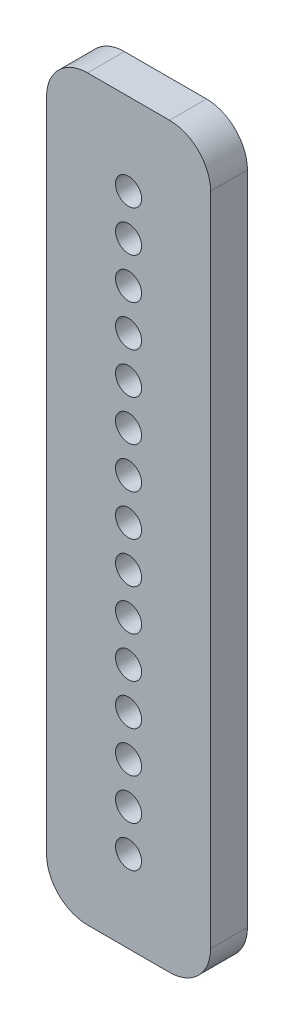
ISO-10303-21;
HEADER;
FILE_DESCRIPTION(('STEP AP214'),'2;1');
FILE_NAME('part.step','',(''),(''),'','','');
FILE_SCHEMA(('AUTOMOTIVE_DESIGN { 1 0 10303 214 1 1 1 1 }'));
ENDSEC;
DATA;
#1=APPLICATION_CONTEXT('core data for automotive mechanical design processes');
#2=APPLICATION_PROTOCOL_DEFINITION('international standard','automotive_design',2000,#1);
#3=PRODUCT_CONTEXT('',#1,'mechanical');
#4=PRODUCT('Part','Part','',(#3));
#5=PRODUCT_RELATED_PRODUCT_CATEGORY('part','',(#4));
#6=PRODUCT_DEFINITION_FORMATION('','',#4);
#7=PRODUCT_DEFINITION_CONTEXT('part definition',#1,'design');
#8=PRODUCT_DEFINITION('design','',#6,#7);
#9=PRODUCT_DEFINITION_SHAPE('','',#8);
#10=(LENGTH_UNIT() NAMED_UNIT(*) SI_UNIT(.MILLI.,.METRE.));
#11=(NAMED_UNIT(*) PLANE_ANGLE_UNIT() SI_UNIT($,.RADIAN.));
#12=(NAMED_UNIT(*) SI_UNIT($,.STERADIAN.) SOLID_ANGLE_UNIT());
#13=UNCERTAINTY_MEASURE_WITH_UNIT(LENGTH_MEASURE(1.E-05),#10,'distance_accuracy_value','');
#14=(GEOMETRIC_REPRESENTATION_CONTEXT(3) GLOBAL_UNCERTAINTY_ASSIGNED_CONTEXT((#13)) GLOBAL_UNIT_ASSIGNED_CONTEXT((#10,
#11,#12)) REPRESENTATION_CONTEXT('',''));
#15=CARTESIAN_POINT('',(0.,0.,0.));
#16=DIRECTION('',(0.,0.,1.));
#17=DIRECTION('',(1.,0.,0.));
#18=AXIS2_PLACEMENT_3D('',#15,#16,#17);
#19=CARTESIAN_POINT('',(12.7,57.15,5.715));
#20=DIRECTION('',(-1.,0.,0.));
#21=DIRECTION('',(0.,-1.,0.));
#22=AXIS2_PLACEMENT_3D('',#19,#20,#21);
#23=PLANE('',#22);
#24=DIRECTION('',(0.,1.,0.));
#25=VECTOR('',#24,1.);
#26=CARTESIAN_POINT('',(12.7,57.15,5.715));
#27=LINE('',#26,#25);
#28=CARTESIAN_POINT('',(12.7,-50.8,5.715));
#29=VERTEX_POINT('',#28);
#30=CARTESIAN_POINT('',(12.7,50.8,5.715));
#31=VERTEX_POINT('',#30);
#32=EDGE_CURVE('E127',#29,#31,#27,.T.);
#33=ORIENTED_EDGE('',*,*,#32,.F.);
#34=DIRECTION('',(0.,0.,-1.));
#35=VECTOR('',#34,1.);
#36=CARTESIAN_POINT('',(12.7,-50.8,5.715));
#37=LINE('',#36,#35);
#38=CARTESIAN_POINT('',(12.7,-50.8,0.));
#39=VERTEX_POINT('',#38);
#40=EDGE_CURVE('E111',#29,#39,#37,.T.);
#41=ORIENTED_EDGE('',*,*,#40,.T.);
#42=DIRECTION('',(0.,1.,0.));
#43=VECTOR('',#42,1.);
#44=CARTESIAN_POINT('',(12.7,57.15,0.));
#45=LINE('',#44,#43);
#46=CARTESIAN_POINT('',(12.7,50.8,0.));
#47=VERTEX_POINT('',#46);
#48=EDGE_CURVE('E124',#39,#47,#45,.T.);
#49=ORIENTED_EDGE('',*,*,#48,.T.);
#50=DIRECTION('',(0.,0.,-1.));
#51=VECTOR('',#50,1.);
#52=CARTESIAN_POINT('',(12.7,50.8,5.715));
#53=LINE('',#52,#51);
#54=EDGE_CURVE('E130',#47,#31,#53,.F.);
#55=ORIENTED_EDGE('',*,*,#54,.T.);
#56=EDGE_LOOP('',(#33,#41,#49,#55));
#57=FACE_BOUND('',#56,.T.);
#58=ADVANCED_FACE('F39',(#57),#23,.F.);
#59=CARTESIAN_POINT('',(-12.7,57.15,5.715));
#60=DIRECTION('',(0.,-1.,0.));
#61=DIRECTION('',(0.,0.,-1.));
#62=AXIS2_PLACEMENT_3D('',#59,#60,#61);
#63=PLANE('',#62);
#64=DIRECTION('',(-1.,0.,0.));
#65=VECTOR('',#64,1.);
#66=CARTESIAN_POINT('',(-12.7,57.15,5.715));
#67=LINE('',#66,#65);
#68=CARTESIAN_POINT('',(6.34999999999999,57.15,5.715));
#69=VERTEX_POINT('',#68);
#70=CARTESIAN_POINT('',(-6.35,57.15,5.715));
#71=VERTEX_POINT('',#70);
#72=EDGE_CURVE('E190',#69,#71,#67,.T.);
#73=ORIENTED_EDGE('',*,*,#72,.F.);
#74=DIRECTION('',(0.,0.,-1.));
#75=VECTOR('',#74,1.);
#76=CARTESIAN_POINT('',(6.34999999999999,57.15,5.715));
#77=LINE('',#76,#75);
#78=CARTESIAN_POINT('',(6.34999999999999,57.15,0.));
#79=VERTEX_POINT('',#78);
#80=EDGE_CURVE('E11',#69,#79,#77,.T.);
#81=ORIENTED_EDGE('',*,*,#80,.T.);
#82=DIRECTION('',(-1.,0.,0.));
#83=VECTOR('',#82,1.);
#84=CARTESIAN_POINT('',(-12.7,57.15,0.));
#85=LINE('',#84,#83);
#86=CARTESIAN_POINT('',(-6.35,57.15,0.));
#87=VERTEX_POINT('',#86);
#88=EDGE_CURVE('E136',#79,#87,#85,.T.);
#89=ORIENTED_EDGE('',*,*,#88,.T.);
#90=DIRECTION('',(0.,0.,-1.));
#91=VECTOR('',#90,1.);
#92=CARTESIAN_POINT('',(-6.35,57.15,5.715));
#93=LINE('',#92,#91);
#94=EDGE_CURVE('E48',#87,#71,#93,.F.);
#95=ORIENTED_EDGE('',*,*,#94,.T.);
#96=EDGE_LOOP('',(#73,#81,#89,#95));
#97=FACE_BOUND('',#96,.T.);
#98=ADVANCED_FACE('F189',(#97),#63,.F.);
#99=CARTESIAN_POINT('',(-12.7,57.15,5.715));
#100=DIRECTION('',(1.,0.,0.));
#101=DIRECTION('',(0.,1.,0.));
#102=AXIS2_PLACEMENT_3D('',#99,#100,#101);
#103=PLANE('',#102);
#104=DIRECTION('',(0.,-1.,0.));
#105=VECTOR('',#104,1.);
#106=CARTESIAN_POINT('',(-12.7,57.15,0.));
#107=LINE('',#106,#105);
#108=CARTESIAN_POINT('',(-12.7,50.8,0.));
#109=VERTEX_POINT('',#108);
#110=CARTESIAN_POINT('',(-12.7,-50.8,0.));
#111=VERTEX_POINT('',#110);
#112=EDGE_CURVE('E142',#109,#111,#107,.T.);
#113=ORIENTED_EDGE('',*,*,#112,.T.);
#114=DIRECTION('',(0.,0.,-1.));
#115=VECTOR('',#114,1.);
#116=CARTESIAN_POINT('',(-12.7,-50.8,5.715));
#117=LINE('',#116,#115);
#118=CARTESIAN_POINT('',(-12.7,-50.8,5.715));
#119=VERTEX_POINT('',#118);
#120=EDGE_CURVE('E55',#111,#119,#117,.F.);
#121=ORIENTED_EDGE('',*,*,#120,.T.);
#122=DIRECTION('',(0.,-1.,0.));
#123=VECTOR('',#122,1.);
#124=CARTESIAN_POINT('',(-12.7,57.15,5.715));
#125=LINE('',#124,#123);
#126=CARTESIAN_POINT('',(-12.7,50.8,5.715));
#127=VERTEX_POINT('',#126);
#128=EDGE_CURVE('E197',#127,#119,#125,.T.);
#129=ORIENTED_EDGE('',*,*,#128,.F.);
#130=DIRECTION('',(0.,0.,-1.));
#131=VECTOR('',#130,1.);
#132=CARTESIAN_POINT('',(-12.7,50.8,5.715));
#133=LINE('',#132,#131);
#134=EDGE_CURVE('E180',#127,#109,#133,.T.);
#135=ORIENTED_EDGE('',*,*,#134,.T.);
#136=EDGE_LOOP('',(#113,#121,#129,#135));
#137=FACE_BOUND('',#136,.T.);
#138=ADVANCED_FACE('F201',(#137),#103,.F.);
#139=CARTESIAN_POINT('',(-12.7,-57.15,5.715));
#140=DIRECTION('',(0.,1.,0.));
#141=DIRECTION('',(0.,0.,1.));
#142=AXIS2_PLACEMENT_3D('',#139,#140,#141);
#143=PLANE('',#142);
#144=DIRECTION('',(1.,0.,0.));
#145=VECTOR('',#144,1.);
#146=CARTESIAN_POINT('',(-12.7,-57.15,0.));
#147=LINE('',#146,#145);
#148=CARTESIAN_POINT('',(-6.34999999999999,-57.15,0.));
#149=VERTEX_POINT('',#148);
#150=CARTESIAN_POINT('',(6.35000000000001,-57.15,0.));
#151=VERTEX_POINT('',#150);
#152=EDGE_CURVE('E153',#149,#151,#147,.T.);
#153=ORIENTED_EDGE('',*,*,#152,.T.);
#154=DIRECTION('',(0.,0.,-1.));
#155=VECTOR('',#154,1.);
#156=CARTESIAN_POINT('',(6.35000000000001,-57.15,5.715));
#157=LINE('',#156,#155);
#158=CARTESIAN_POINT('',(6.35000000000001,-57.15,5.715));
#159=VERTEX_POINT('',#158);
#160=EDGE_CURVE('E112',#151,#159,#157,.F.);
#161=ORIENTED_EDGE('',*,*,#160,.T.);
#162=DIRECTION('',(1.,0.,0.));
#163=VECTOR('',#162,1.);
#164=CARTESIAN_POINT('',(-12.7,-57.15,5.715));
#165=LINE('',#164,#163);
#166=CARTESIAN_POINT('',(-6.34999999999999,-57.15,5.715));
#167=VERTEX_POINT('',#166);
#168=EDGE_CURVE('E148',#167,#159,#165,.T.);
#169=ORIENTED_EDGE('',*,*,#168,.F.);
#170=DIRECTION('',(0.,0.,-1.));
#171=VECTOR('',#170,1.);
#172=CARTESIAN_POINT('',(-6.34999999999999,-57.15,5.715));
#173=LINE('',#172,#171);
#174=EDGE_CURVE('E118',#167,#149,#173,.T.);
#175=ORIENTED_EDGE('',*,*,#174,.T.);
#176=EDGE_LOOP('',(#153,#161,#169,#175));
#177=FACE_BOUND('',#176,.T.);
#178=ADVANCED_FACE('F208',(#177),#143,.F.);
#179=CARTESIAN_POINT('',(0.,0.,5.715));
#180=DIRECTION('',(0.,0.,1.));
#181=DIRECTION('',(1.,0.,0.));
#182=AXIS2_PLACEMENT_3D('',#179,#180,#181);
#183=PLANE('',#182);
#184=CARTESIAN_POINT('',(4.65589036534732E-13,-44.45,5.715));
#185=DIRECTION('',(0.,0.,1.));
#186=DIRECTION('',(1.,0.,0.));
#187=AXIS2_PLACEMENT_3D('',#184,#185,#186);
#188=CIRCLE('',#187,2.0193);
#189=CARTESIAN_POINT('',(2.01930000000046,-44.45,5.715));
#190=VERTEX_POINT('',#189);
#191=EDGE_CURVE('E218',#190,#190,#188,.T.);
#192=ORIENTED_EDGE('',*,*,#191,.F.);
#193=EDGE_LOOP('',(#192));
#194=FACE_BOUND('',#193,.T.);
#195=CARTESIAN_POINT('',(3.9907631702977E-13,-38.1,5.715));
#196=DIRECTION('',(0.,0.,1.));
#197=DIRECTION('',(1.,0.,0.));
#198=AXIS2_PLACEMENT_3D('',#195,#196,#197);
#199=CIRCLE('',#198,2.0193);
#200=CARTESIAN_POINT('',(2.0193000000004,-38.1,5.715));
#201=VERTEX_POINT('',#200);
#202=EDGE_CURVE('E226',#201,#201,#199,.T.);
#203=ORIENTED_EDGE('',*,*,#202,.F.);
#204=EDGE_LOOP('',(#203));
#205=FACE_BOUND('',#204,.T.);
#206=CARTESIAN_POINT('',(3.32563597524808E-13,-31.75,5.715));
#207=DIRECTION('',(0.,0.,1.));
#208=DIRECTION('',(1.,0.,0.));
#209=AXIS2_PLACEMENT_3D('',#206,#207,#208);
#210=CIRCLE('',#209,2.0193);
#211=CARTESIAN_POINT('',(2.01930000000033,-31.75,5.715));
#212=VERTEX_POINT('',#211);
#213=EDGE_CURVE('E234',#212,#212,#210,.T.);
#214=ORIENTED_EDGE('',*,*,#213,.F.);
#215=EDGE_LOOP('',(#214));
#216=FACE_BOUND('',#215,.T.);
#217=CARTESIAN_POINT('',(2.66050878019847E-13,-25.4,5.715));
#218=DIRECTION('',(0.,0.,1.));
#219=DIRECTION('',(1.,0.,0.));
#220=AXIS2_PLACEMENT_3D('',#217,#218,#219);
#221=CIRCLE('',#220,2.0193);
#222=CARTESIAN_POINT('',(2.01930000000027,-25.4,5.715));
#223=VERTEX_POINT('',#222);
#224=EDGE_CURVE('E242',#223,#223,#221,.T.);
#225=ORIENTED_EDGE('',*,*,#224,.F.);
#226=EDGE_LOOP('',(#225));
#227=FACE_BOUND('',#226,.T.);
#228=CARTESIAN_POINT('',(1.99538158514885E-13,-19.05,5.715));
#229=DIRECTION('',(0.,0.,1.));
#230=DIRECTION('',(1.,0.,0.));
#231=AXIS2_PLACEMENT_3D('',#228,#229,#230);
#232=CIRCLE('',#231,2.0193);
#233=CARTESIAN_POINT('',(2.0193000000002,-19.05,5.715));
#234=VERTEX_POINT('',#233);
#235=EDGE_CURVE('E250',#234,#234,#232,.T.);
#236=ORIENTED_EDGE('',*,*,#235,.F.);
#237=EDGE_LOOP('',(#236));
#238=FACE_BOUND('',#237,.T.);
#239=CARTESIAN_POINT('',(1.33025439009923E-13,-12.7,5.715));
#240=DIRECTION('',(0.,0.,1.));
#241=DIRECTION('',(1.,0.,0.));
#242=AXIS2_PLACEMENT_3D('',#239,#240,#241);
#243=CIRCLE('',#242,2.0193);
#244=CARTESIAN_POINT('',(2.01930000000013,-12.7,5.715));
#245=VERTEX_POINT('',#244);
#246=EDGE_CURVE('E258',#245,#245,#243,.T.);
#247=ORIENTED_EDGE('',*,*,#246,.F.);
#248=EDGE_LOOP('',(#247));
#249=FACE_BOUND('',#248,.T.);
#250=CARTESIAN_POINT('',(0.,6.35,5.715));
#251=DIRECTION('',(0.,0.,1.));
#252=DIRECTION('',(1.,0.,0.));
#253=AXIS2_PLACEMENT_3D('',#250,#251,#252);
#254=CIRCLE('',#253,2.0193);
#255=CARTESIAN_POINT('',(2.01929999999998,6.35,5.715));
#256=VERTEX_POINT('',#255);
#257=EDGE_CURVE('E292',#256,#256,#254,.T.);
#258=ORIENTED_EDGE('',*,*,#257,.F.);
#259=EDGE_LOOP('',(#258));
#260=FACE_BOUND('',#259,.T.);
#261=CARTESIAN_POINT('',(0.,12.7,5.715));
#262=DIRECTION('',(0.,0.,1.));
#263=DIRECTION('',(1.,0.,0.));
#264=AXIS2_PLACEMENT_3D('',#261,#262,#263);
#265=CIRCLE('',#264,2.0193);
#266=CARTESIAN_POINT('',(2.01929999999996,12.7,5.715));
#267=VERTEX_POINT('',#266);
#268=EDGE_CURVE('E284',#267,#267,#265,.T.);
#269=ORIENTED_EDGE('',*,*,#268,.F.);
#270=EDGE_LOOP('',(#269));
#271=FACE_BOUND('',#270,.T.);
#272=CARTESIAN_POINT('',(0.,19.05,5.715));
#273=DIRECTION('',(0.,0.,1.));
#274=DIRECTION('',(1.,0.,0.));
#275=AXIS2_PLACEMENT_3D('',#272,#273,#274);
#276=CIRCLE('',#275,2.0193);
#277=CARTESIAN_POINT('',(2.01929999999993,19.05,5.715));
#278=VERTEX_POINT('',#277);
#279=EDGE_CURVE('E276',#278,#278,#276,.T.);
#280=ORIENTED_EDGE('',*,*,#279,.F.);
#281=EDGE_LOOP('',(#280));
#282=FACE_BOUND('',#281,.T.);
#283=CARTESIAN_POINT('',(0.,25.4,5.715));
#284=DIRECTION('',(0.,0.,1.));
#285=DIRECTION('',(1.,0.,0.));
#286=AXIS2_PLACEMENT_3D('',#283,#284,#285);
#287=CIRCLE('',#286,2.0193);
#288=CARTESIAN_POINT('',(2.01929999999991,25.4,5.715));
#289=VERTEX_POINT('',#288);
#290=EDGE_CURVE('E267',#289,#289,#287,.T.);
#291=ORIENTED_EDGE('',*,*,#290,.F.);
#292=EDGE_LOOP('',(#291));
#293=FACE_BOUND('',#292,.T.);
#294=CARTESIAN_POINT('',(0.,-6.35,5.715));
#295=DIRECTION('',(0.,0.,1.));
#296=DIRECTION('',(1.,0.,0.));
#297=AXIS2_PLACEMENT_3D('',#294,#295,#296);
#298=CIRCLE('',#297,2.0193);
#299=CARTESIAN_POINT('',(2.01930000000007,-6.35,5.715));
#300=VERTEX_POINT('',#299);
#301=EDGE_CURVE('E266',#300,#300,#298,.T.);
#302=ORIENTED_EDGE('',*,*,#301,.F.);
#303=EDGE_LOOP('',(#302));
#304=FACE_BOUND('',#303,.T.);
#305=CARTESIAN_POINT('',(-1.55196345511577E-13,44.45,5.715));
#306=DIRECTION('',(0.,0.,1.));
#307=DIRECTION('',(1.,0.,0.));
#308=AXIS2_PLACEMENT_3D('',#305,#306,#307);
#309=CIRCLE('',#308,2.0193);
#310=CARTESIAN_POINT('',(2.01929999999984,44.45,5.715));
#311=VERTEX_POINT('',#310);
#312=EDGE_CURVE('E322',#311,#311,#309,.T.);
#313=ORIENTED_EDGE('',*,*,#312,.F.);
#314=EDGE_LOOP('',(#313));
#315=FACE_BOUND('',#314,.T.);
#316=CARTESIAN_POINT('',(-1.33025439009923E-13,38.1,5.715));
#317=DIRECTION('',(0.,0.,1.));
#318=DIRECTION('',(1.,0.,0.));
#319=AXIS2_PLACEMENT_3D('',#316,#317,#318);
#320=CIRCLE('',#319,2.0193);
#321=CARTESIAN_POINT('',(2.01929999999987,38.1,5.715));
#322=VERTEX_POINT('',#321);
#323=EDGE_CURVE('E299',#322,#322,#320,.T.);
#324=ORIENTED_EDGE('',*,*,#323,.F.);
#325=EDGE_LOOP('',(#324));
#326=FACE_BOUND('',#325,.T.);
#327=CARTESIAN_POINT('',(-1.10854532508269E-13,31.75,5.715));
#328=DIRECTION('',(0.,0.,1.));
#329=DIRECTION('',(1.,0.,0.));
#330=AXIS2_PLACEMENT_3D('',#327,#328,#329);
#331=CIRCLE('',#330,2.0193);
#332=CARTESIAN_POINT('',(2.01929999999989,31.75,5.715));
#333=VERTEX_POINT('',#332);
#334=EDGE_CURVE('E308',#333,#333,#331,.T.);
#335=ORIENTED_EDGE('',*,*,#334,.F.);
#336=EDGE_LOOP('',(#335));
#337=FACE_BOUND('',#336,.T.);
#338=CARTESIAN_POINT('',(0.,0.,5.715));
#339=DIRECTION('',(0.,0.,1.));
#340=DIRECTION('',(1.,0.,0.));
#341=AXIS2_PLACEMENT_3D('',#338,#339,#340);
#342=CIRCLE('',#341,2.0193);
#343=CARTESIAN_POINT('',(2.0193,0.,5.715));
#344=VERTEX_POINT('',#343);
#345=EDGE_CURVE('E145',#344,#344,#342,.T.);
#346=ORIENTED_EDGE('',*,*,#345,.F.);
#347=EDGE_LOOP('',(#346));
#348=FACE_BOUND('',#347,.T.);
#349=ORIENTED_EDGE('',*,*,#168,.T.);
#350=CARTESIAN_POINT('',(6.35000000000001,-50.8,5.715));
#351=DIRECTION('',(0.,0.,1.));
#352=DIRECTION('',(1.,0.,0.));
#353=AXIS2_PLACEMENT_3D('',#350,#351,#352);
#354=CIRCLE('',#353,6.35);
#355=EDGE_CURVE('E177',#159,#29,#354,.T.);
#356=ORIENTED_EDGE('',*,*,#355,.T.);
#357=ORIENTED_EDGE('',*,*,#32,.T.);
#358=CARTESIAN_POINT('',(6.34999999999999,50.8,5.715));
#359=DIRECTION('',(0.,0.,1.));
#360=DIRECTION('',(1.,0.,0.));
#361=AXIS2_PLACEMENT_3D('',#358,#359,#360);
#362=CIRCLE('',#361,6.35);
#363=EDGE_CURVE('E171',#31,#69,#362,.T.);
#364=ORIENTED_EDGE('',*,*,#363,.T.);
#365=ORIENTED_EDGE('',*,*,#72,.T.);
#366=CARTESIAN_POINT('',(-6.35,50.8,5.715));
#367=DIRECTION('',(0.,0.,1.));
#368=DIRECTION('',(1.,0.,0.));
#369=AXIS2_PLACEMENT_3D('',#366,#367,#368);
#370=CIRCLE('',#369,6.35);
#371=EDGE_CURVE('E62',#71,#127,#370,.T.);
#372=ORIENTED_EDGE('',*,*,#371,.T.);
#373=ORIENTED_EDGE('',*,*,#128,.T.);
#374=CARTESIAN_POINT('',(-6.34999999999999,-50.8,5.715));
#375=DIRECTION('',(0.,0.,1.));
#376=DIRECTION('',(1.,0.,0.));
#377=AXIS2_PLACEMENT_3D('',#374,#375,#376);
#378=CIRCLE('',#377,6.35);
#379=EDGE_CURVE('E174',#119,#167,#378,.T.);
#380=ORIENTED_EDGE('',*,*,#379,.T.);
#381=EDGE_LOOP('',(#349,#356,#357,#364,#365,#372,#373,#380));
#382=FACE_BOUND('',#381,.T.);
#383=ADVANCED_FACE('F194',(#194,#205,#216,#227,#238,#249,#260,#271,#282,#293,#304,#315,#326,
#337,#348,#382),#183,.T.);
#384=CARTESIAN_POINT('',(0.,0.,0.));
#385=DIRECTION('',(0.,0.,1.));
#386=DIRECTION('',(1.,0.,0.));
#387=AXIS2_PLACEMENT_3D('',#384,#385,#386);
#388=PLANE('',#387);
#389=CARTESIAN_POINT('',(4.65589036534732E-13,-44.45,0.));
#390=DIRECTION('',(0.,0.,1.));
#391=DIRECTION('',(1.,0.,0.));
#392=AXIS2_PLACEMENT_3D('',#389,#390,#391);
#393=CIRCLE('',#392,2.0193);
#394=CARTESIAN_POINT('',(2.01930000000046,-44.45,0.));
#395=VERTEX_POINT('',#394);
#396=EDGE_CURVE('E222',#395,#395,#393,.T.);
#397=ORIENTED_EDGE('',*,*,#396,.T.);
#398=EDGE_LOOP('',(#397));
#399=FACE_BOUND('',#398,.T.);
#400=CARTESIAN_POINT('',(3.9907631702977E-13,-38.1,0.));
#401=DIRECTION('',(0.,0.,1.));
#402=DIRECTION('',(1.,0.,0.));
#403=AXIS2_PLACEMENT_3D('',#400,#401,#402);
#404=CIRCLE('',#403,2.0193);
#405=CARTESIAN_POINT('',(2.0193000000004,-38.1,0.));
#406=VERTEX_POINT('',#405);
#407=EDGE_CURVE('E230',#406,#406,#404,.T.);
#408=ORIENTED_EDGE('',*,*,#407,.T.);
#409=EDGE_LOOP('',(#408));
#410=FACE_BOUND('',#409,.T.);
#411=CARTESIAN_POINT('',(3.32563597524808E-13,-31.75,0.));
#412=DIRECTION('',(0.,0.,1.));
#413=DIRECTION('',(1.,0.,0.));
#414=AXIS2_PLACEMENT_3D('',#411,#412,#413);
#415=CIRCLE('',#414,2.0193);
#416=CARTESIAN_POINT('',(2.01930000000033,-31.75,0.));
#417=VERTEX_POINT('',#416);
#418=EDGE_CURVE('E238',#417,#417,#415,.T.);
#419=ORIENTED_EDGE('',*,*,#418,.T.);
#420=EDGE_LOOP('',(#419));
#421=FACE_BOUND('',#420,.T.);
#422=CARTESIAN_POINT('',(2.66050878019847E-13,-25.4,0.));
#423=DIRECTION('',(0.,0.,1.));
#424=DIRECTION('',(1.,0.,0.));
#425=AXIS2_PLACEMENT_3D('',#422,#423,#424);
#426=CIRCLE('',#425,2.0193);
#427=CARTESIAN_POINT('',(2.01930000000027,-25.4,0.));
#428=VERTEX_POINT('',#427);
#429=EDGE_CURVE('E246',#428,#428,#426,.T.);
#430=ORIENTED_EDGE('',*,*,#429,.T.);
#431=EDGE_LOOP('',(#430));
#432=FACE_BOUND('',#431,.T.);
#433=CARTESIAN_POINT('',(1.99538158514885E-13,-19.05,0.));
#434=DIRECTION('',(0.,0.,1.));
#435=DIRECTION('',(1.,0.,0.));
#436=AXIS2_PLACEMENT_3D('',#433,#434,#435);
#437=CIRCLE('',#436,2.0193);
#438=CARTESIAN_POINT('',(2.0193000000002,-19.05,0.));
#439=VERTEX_POINT('',#438);
#440=EDGE_CURVE('E254',#439,#439,#437,.T.);
#441=ORIENTED_EDGE('',*,*,#440,.T.);
#442=EDGE_LOOP('',(#441));
#443=FACE_BOUND('',#442,.T.);
#444=CARTESIAN_POINT('',(1.33025439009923E-13,-12.7,0.));
#445=DIRECTION('',(0.,0.,1.));
#446=DIRECTION('',(1.,0.,0.));
#447=AXIS2_PLACEMENT_3D('',#444,#445,#446);
#448=CIRCLE('',#447,2.0193);
#449=CARTESIAN_POINT('',(2.01930000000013,-12.7,0.));
#450=VERTEX_POINT('',#449);
#451=EDGE_CURVE('E262',#450,#450,#448,.T.);
#452=ORIENTED_EDGE('',*,*,#451,.T.);
#453=EDGE_LOOP('',(#452));
#454=FACE_BOUND('',#453,.T.);
#455=CARTESIAN_POINT('',(0.,6.35,0.));
#456=DIRECTION('',(0.,0.,1.));
#457=DIRECTION('',(1.,0.,0.));
#458=AXIS2_PLACEMENT_3D('',#455,#456,#457);
#459=CIRCLE('',#458,2.0193);
#460=CARTESIAN_POINT('',(2.01929999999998,6.35,0.));
#461=VERTEX_POINT('',#460);
#462=EDGE_CURVE('E216',#461,#461,#459,.T.);
#463=ORIENTED_EDGE('',*,*,#462,.T.);
#464=EDGE_LOOP('',(#463));
#465=FACE_BOUND('',#464,.T.);
#466=CARTESIAN_POINT('',(0.,12.7,0.));
#467=DIRECTION('',(0.,0.,1.));
#468=DIRECTION('',(1.,0.,0.));
#469=AXIS2_PLACEMENT_3D('',#466,#467,#468);
#470=CIRCLE('',#469,2.0193);
#471=CARTESIAN_POINT('',(2.01929999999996,12.7,0.));
#472=VERTEX_POINT('',#471);
#473=EDGE_CURVE('E288',#472,#472,#470,.T.);
#474=ORIENTED_EDGE('',*,*,#473,.T.);
#475=EDGE_LOOP('',(#474));
#476=FACE_BOUND('',#475,.T.);
#477=CARTESIAN_POINT('',(0.,19.05,0.));
#478=DIRECTION('',(0.,0.,1.));
#479=DIRECTION('',(1.,0.,0.));
#480=AXIS2_PLACEMENT_3D('',#477,#478,#479);
#481=CIRCLE('',#480,2.0193);
#482=CARTESIAN_POINT('',(2.01929999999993,19.05,0.));
#483=VERTEX_POINT('',#482);
#484=EDGE_CURVE('E280',#483,#483,#481,.T.);
#485=ORIENTED_EDGE('',*,*,#484,.T.);
#486=EDGE_LOOP('',(#485));
#487=FACE_BOUND('',#486,.T.);
#488=CARTESIAN_POINT('',(0.,25.4,0.));
#489=DIRECTION('',(0.,0.,1.));
#490=DIRECTION('',(1.,0.,0.));
#491=AXIS2_PLACEMENT_3D('',#488,#489,#490);
#492=CIRCLE('',#491,2.0193);
#493=CARTESIAN_POINT('',(2.01929999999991,25.4,0.));
#494=VERTEX_POINT('',#493);
#495=EDGE_CURVE('E271',#494,#494,#492,.T.);
#496=ORIENTED_EDGE('',*,*,#495,.T.);
#497=EDGE_LOOP('',(#496));
#498=FACE_BOUND('',#497,.T.);
#499=CARTESIAN_POINT('',(0.,-6.35,0.));
#500=DIRECTION('',(0.,0.,1.));
#501=DIRECTION('',(1.,0.,0.));
#502=AXIS2_PLACEMENT_3D('',#499,#500,#501);
#503=CIRCLE('',#502,2.0193);
#504=CARTESIAN_POINT('',(2.01930000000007,-6.35,0.));
#505=VERTEX_POINT('',#504);
#506=EDGE_CURVE('E318',#505,#505,#503,.T.);
#507=ORIENTED_EDGE('',*,*,#506,.T.);
#508=EDGE_LOOP('',(#507));
#509=FACE_BOUND('',#508,.T.);
#510=CARTESIAN_POINT('',(-1.55196345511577E-13,44.45,0.));
#511=DIRECTION('',(0.,0.,1.));
#512=DIRECTION('',(1.,0.,0.));
#513=AXIS2_PLACEMENT_3D('',#510,#511,#512);
#514=CIRCLE('',#513,2.0193);
#515=CARTESIAN_POINT('',(2.01929999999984,44.45,0.));
#516=VERTEX_POINT('',#515);
#517=EDGE_CURVE('E304',#516,#516,#514,.T.);
#518=ORIENTED_EDGE('',*,*,#517,.T.);
#519=EDGE_LOOP('',(#518));
#520=FACE_BOUND('',#519,.T.);
#521=CARTESIAN_POINT('',(-1.33025439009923E-13,38.1,0.));
#522=DIRECTION('',(0.,0.,1.));
#523=DIRECTION('',(1.,0.,0.));
#524=AXIS2_PLACEMENT_3D('',#521,#522,#523);
#525=CIRCLE('',#524,2.0193);
#526=CARTESIAN_POINT('',(2.01929999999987,38.1,0.));
#527=VERTEX_POINT('',#526);
#528=EDGE_CURVE('E303',#527,#527,#525,.T.);
#529=ORIENTED_EDGE('',*,*,#528,.T.);
#530=EDGE_LOOP('',(#529));
#531=FACE_BOUND('',#530,.T.);
#532=CARTESIAN_POINT('',(-1.10854532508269E-13,31.75,0.));
#533=DIRECTION('',(0.,0.,1.));
#534=DIRECTION('',(1.,0.,0.));
#535=AXIS2_PLACEMENT_3D('',#532,#533,#534);
#536=CIRCLE('',#535,2.0193);
#537=CARTESIAN_POINT('',(2.01929999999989,31.75,0.));
#538=VERTEX_POINT('',#537);
#539=EDGE_CURVE('E272',#538,#538,#536,.T.);
#540=ORIENTED_EDGE('',*,*,#539,.T.);
#541=EDGE_LOOP('',(#540));
#542=FACE_BOUND('',#541,.T.);
#543=CARTESIAN_POINT('',(0.,0.,0.));
#544=DIRECTION('',(0.,0.,1.));
#545=DIRECTION('',(1.,0.,0.));
#546=AXIS2_PLACEMENT_3D('',#543,#544,#545);
#547=CIRCLE('',#546,2.0193);
#548=CARTESIAN_POINT('',(2.0193,0.,0.));
#549=VERTEX_POINT('',#548);
#550=EDGE_CURVE('E137',#549,#549,#547,.T.);
#551=ORIENTED_EDGE('',*,*,#550,.T.);
#552=EDGE_LOOP('',(#551));
#553=FACE_BOUND('',#552,.T.);
#554=ORIENTED_EDGE('',*,*,#48,.F.);
#555=CARTESIAN_POINT('',(6.35000000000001,-50.8,0.));
#556=DIRECTION('',(0.,0.,1.));
#557=DIRECTION('',(1.,0.,0.));
#558=AXIS2_PLACEMENT_3D('',#555,#556,#557);
#559=CIRCLE('',#558,6.35);
#560=EDGE_CURVE('E107',#39,#151,#559,.F.);
#561=ORIENTED_EDGE('',*,*,#560,.T.);
#562=ORIENTED_EDGE('',*,*,#152,.F.);
#563=CARTESIAN_POINT('',(-6.34999999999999,-50.8,0.));
#564=DIRECTION('',(0.,0.,1.));
#565=DIRECTION('',(1.,0.,0.));
#566=AXIS2_PLACEMENT_3D('',#563,#564,#565);
#567=CIRCLE('',#566,6.35);
#568=EDGE_CURVE('E119',#149,#111,#567,.F.);
#569=ORIENTED_EDGE('',*,*,#568,.T.);
#570=ORIENTED_EDGE('',*,*,#112,.F.);
#571=CARTESIAN_POINT('',(-6.35,50.8,0.));
#572=DIRECTION('',(0.,0.,1.));
#573=DIRECTION('',(1.,0.,0.));
#574=AXIS2_PLACEMENT_3D('',#571,#572,#573);
#575=CIRCLE('',#574,6.35);
#576=EDGE_CURVE('E129',#109,#87,#575,.F.);
#577=ORIENTED_EDGE('',*,*,#576,.T.);
#578=ORIENTED_EDGE('',*,*,#88,.F.);
#579=CARTESIAN_POINT('',(6.34999999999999,50.8,0.));
#580=DIRECTION('',(0.,0.,1.));
#581=DIRECTION('',(1.,0.,0.));
#582=AXIS2_PLACEMENT_3D('',#579,#580,#581);
#583=CIRCLE('',#582,6.35);
#584=EDGE_CURVE('E134',#79,#47,#583,.F.);
#585=ORIENTED_EDGE('',*,*,#584,.T.);
#586=EDGE_LOOP('',(#554,#561,#562,#569,#570,#577,#578,#585));
#587=FACE_BOUND('',#586,.T.);
#588=ADVANCED_FACE('F132',(#399,#410,#421,#432,#443,#454,#465,#476,#487,#498,#509,#520,#531,
#542,#553,#587),#388,.F.);
#589=CARTESIAN_POINT('',(0.,0.,0.));
#590=DIRECTION('',(0.,0.,1.));
#591=DIRECTION('',(1.,0.,0.));
#592=AXIS2_PLACEMENT_3D('',#589,#590,#591);
#593=CYLINDRICAL_SURFACE('',#592,2.0193);
#594=ORIENTED_EDGE('',*,*,#550,.F.);
#595=EDGE_LOOP('',(#594));
#596=FACE_BOUND('',#595,.T.);
#597=ORIENTED_EDGE('',*,*,#345,.T.);
#598=EDGE_LOOP('',(#597));
#599=FACE_BOUND('',#598,.T.);
#600=ADVANCED_FACE('F350',(#596,#599),#593,.F.);
#601=CARTESIAN_POINT('',(-1.10854532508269E-13,31.75,0.));
#602=DIRECTION('',(0.,0.,1.));
#603=DIRECTION('',(1.,0.,0.));
#604=AXIS2_PLACEMENT_3D('',#601,#602,#603);
#605=CYLINDRICAL_SURFACE('',#604,2.0193);
#606=ORIENTED_EDGE('',*,*,#539,.F.);
#607=EDGE_LOOP('',(#606));
#608=FACE_BOUND('',#607,.T.);
#609=ORIENTED_EDGE('',*,*,#334,.T.);
#610=EDGE_LOOP('',(#609));
#611=FACE_BOUND('',#610,.T.);
#612=ADVANCED_FACE('F352',(#608,#611),#605,.F.);
#613=CARTESIAN_POINT('',(-1.33025439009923E-13,38.1,0.));
#614=DIRECTION('',(0.,0.,1.));
#615=DIRECTION('',(1.,0.,0.));
#616=AXIS2_PLACEMENT_3D('',#613,#614,#615);
#617=CYLINDRICAL_SURFACE('',#616,2.0193);
#618=ORIENTED_EDGE('',*,*,#528,.F.);
#619=EDGE_LOOP('',(#618));
#620=FACE_BOUND('',#619,.T.);
#621=ORIENTED_EDGE('',*,*,#323,.T.);
#622=EDGE_LOOP('',(#621));
#623=FACE_BOUND('',#622,.T.);
#624=ADVANCED_FACE('F336',(#620,#623),#617,.F.);
#625=CARTESIAN_POINT('',(-1.55196345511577E-13,44.45,0.));
#626=DIRECTION('',(0.,0.,1.));
#627=DIRECTION('',(1.,0.,0.));
#628=AXIS2_PLACEMENT_3D('',#625,#626,#627);
#629=CYLINDRICAL_SURFACE('',#628,2.0193);
#630=ORIENTED_EDGE('',*,*,#517,.F.);
#631=EDGE_LOOP('',(#630));
#632=FACE_BOUND('',#631,.T.);
#633=ORIENTED_EDGE('',*,*,#312,.T.);
#634=EDGE_LOOP('',(#633));
#635=FACE_BOUND('',#634,.T.);
#636=ADVANCED_FACE('F332',(#632,#635),#629,.F.);
#637=CARTESIAN_POINT('',(0.,-6.35,0.));
#638=DIRECTION('',(0.,0.,1.));
#639=DIRECTION('',(1.,0.,0.));
#640=AXIS2_PLACEMENT_3D('',#637,#638,#639);
#641=CYLINDRICAL_SURFACE('',#640,2.0193);
#642=ORIENTED_EDGE('',*,*,#506,.F.);
#643=EDGE_LOOP('',(#642));
#644=FACE_BOUND('',#643,.T.);
#645=ORIENTED_EDGE('',*,*,#301,.T.);
#646=EDGE_LOOP('',(#645));
#647=FACE_BOUND('',#646,.T.);
#648=ADVANCED_FACE('F335',(#644,#647),#641,.F.);
#649=CARTESIAN_POINT('',(0.,25.4,0.));
#650=DIRECTION('',(0.,0.,1.));
#651=DIRECTION('',(1.,0.,0.));
#652=AXIS2_PLACEMENT_3D('',#649,#650,#651);
#653=CYLINDRICAL_SURFACE('',#652,2.0193);
#654=ORIENTED_EDGE('',*,*,#495,.F.);
#655=EDGE_LOOP('',(#654));
#656=FACE_BOUND('',#655,.T.);
#657=ORIENTED_EDGE('',*,*,#290,.T.);
#658=EDGE_LOOP('',(#657));
#659=FACE_BOUND('',#658,.T.);
#660=ADVANCED_FACE('F527',(#656,#659),#653,.F.);
#661=CARTESIAN_POINT('',(0.,19.05,0.));
#662=DIRECTION('',(0.,0.,1.));
#663=DIRECTION('',(1.,0.,0.));
#664=AXIS2_PLACEMENT_3D('',#661,#662,#663);
#665=CYLINDRICAL_SURFACE('',#664,2.0193);
#666=ORIENTED_EDGE('',*,*,#484,.F.);
#667=EDGE_LOOP('',(#666));
#668=FACE_BOUND('',#667,.T.);
#669=ORIENTED_EDGE('',*,*,#279,.T.);
#670=EDGE_LOOP('',(#669));
#671=FACE_BOUND('',#670,.T.);
#672=ADVANCED_FACE('F517',(#668,#671),#665,.F.);
#673=CARTESIAN_POINT('',(0.,12.7,0.));
#674=DIRECTION('',(0.,0.,1.));
#675=DIRECTION('',(1.,0.,0.));
#676=AXIS2_PLACEMENT_3D('',#673,#674,#675);
#677=CYLINDRICAL_SURFACE('',#676,2.0193);
#678=ORIENTED_EDGE('',*,*,#473,.F.);
#679=EDGE_LOOP('',(#678));
#680=FACE_BOUND('',#679,.T.);
#681=ORIENTED_EDGE('',*,*,#268,.T.);
#682=EDGE_LOOP('',(#681));
#683=FACE_BOUND('',#682,.T.);
#684=ADVANCED_FACE('F507',(#680,#683),#677,.F.);
#685=CARTESIAN_POINT('',(0.,6.35,0.));
#686=DIRECTION('',(0.,0.,1.));
#687=DIRECTION('',(1.,0.,0.));
#688=AXIS2_PLACEMENT_3D('',#685,#686,#687);
#689=CYLINDRICAL_SURFACE('',#688,2.0193);
#690=ORIENTED_EDGE('',*,*,#462,.F.);
#691=EDGE_LOOP('',(#690));
#692=FACE_BOUND('',#691,.T.);
#693=ORIENTED_EDGE('',*,*,#257,.T.);
#694=EDGE_LOOP('',(#693));
#695=FACE_BOUND('',#694,.T.);
#696=ADVANCED_FACE('F497',(#692,#695),#689,.F.);
#697=CARTESIAN_POINT('',(1.33025439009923E-13,-12.7,0.));
#698=DIRECTION('',(0.,0.,1.));
#699=DIRECTION('',(1.,0.,0.));
#700=AXIS2_PLACEMENT_3D('',#697,#698,#699);
#701=CYLINDRICAL_SURFACE('',#700,2.0193);
#702=ORIENTED_EDGE('',*,*,#451,.F.);
#703=EDGE_LOOP('',(#702));
#704=FACE_BOUND('',#703,.T.);
#705=ORIENTED_EDGE('',*,*,#246,.T.);
#706=EDGE_LOOP('',(#705));
#707=FACE_BOUND('',#706,.T.);
#708=ADVANCED_FACE('F487',(#704,#707),#701,.F.);
#709=CARTESIAN_POINT('',(1.99538158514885E-13,-19.05,0.));
#710=DIRECTION('',(0.,0.,1.));
#711=DIRECTION('',(1.,0.,0.));
#712=AXIS2_PLACEMENT_3D('',#709,#710,#711);
#713=CYLINDRICAL_SURFACE('',#712,2.0193);
#714=ORIENTED_EDGE('',*,*,#440,.F.);
#715=EDGE_LOOP('',(#714));
#716=FACE_BOUND('',#715,.T.);
#717=ORIENTED_EDGE('',*,*,#235,.T.);
#718=EDGE_LOOP('',(#717));
#719=FACE_BOUND('',#718,.T.);
#720=ADVANCED_FACE('F477',(#716,#719),#713,.F.);
#721=CARTESIAN_POINT('',(2.66050878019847E-13,-25.4,0.));
#722=DIRECTION('',(0.,0.,1.));
#723=DIRECTION('',(1.,0.,0.));
#724=AXIS2_PLACEMENT_3D('',#721,#722,#723);
#725=CYLINDRICAL_SURFACE('',#724,2.0193);
#726=ORIENTED_EDGE('',*,*,#429,.F.);
#727=EDGE_LOOP('',(#726));
#728=FACE_BOUND('',#727,.T.);
#729=ORIENTED_EDGE('',*,*,#224,.T.);
#730=EDGE_LOOP('',(#729));
#731=FACE_BOUND('',#730,.T.);
#732=ADVANCED_FACE('F467',(#728,#731),#725,.F.);
#733=CARTESIAN_POINT('',(3.32563597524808E-13,-31.75,0.));
#734=DIRECTION('',(0.,0.,1.));
#735=DIRECTION('',(1.,0.,0.));
#736=AXIS2_PLACEMENT_3D('',#733,#734,#735);
#737=CYLINDRICAL_SURFACE('',#736,2.0193);
#738=ORIENTED_EDGE('',*,*,#418,.F.);
#739=EDGE_LOOP('',(#738));
#740=FACE_BOUND('',#739,.T.);
#741=ORIENTED_EDGE('',*,*,#213,.T.);
#742=EDGE_LOOP('',(#741));
#743=FACE_BOUND('',#742,.T.);
#744=ADVANCED_FACE('F457',(#740,#743),#737,.F.);
#745=CARTESIAN_POINT('',(3.9907631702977E-13,-38.1,0.));
#746=DIRECTION('',(0.,0.,1.));
#747=DIRECTION('',(1.,0.,0.));
#748=AXIS2_PLACEMENT_3D('',#745,#746,#747);
#749=CYLINDRICAL_SURFACE('',#748,2.0193);
#750=ORIENTED_EDGE('',*,*,#407,.F.);
#751=EDGE_LOOP('',(#750));
#752=FACE_BOUND('',#751,.T.);
#753=ORIENTED_EDGE('',*,*,#202,.T.);
#754=EDGE_LOOP('',(#753));
#755=FACE_BOUND('',#754,.T.);
#756=ADVANCED_FACE('F448',(#752,#755),#749,.F.);
#757=CARTESIAN_POINT('',(4.65589036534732E-13,-44.45,0.));
#758=DIRECTION('',(0.,0.,1.));
#759=DIRECTION('',(1.,0.,0.));
#760=AXIS2_PLACEMENT_3D('',#757,#758,#759);
#761=CYLINDRICAL_SURFACE('',#760,2.0193);
#762=ORIENTED_EDGE('',*,*,#396,.F.);
#763=EDGE_LOOP('',(#762));
#764=FACE_BOUND('',#763,.T.);
#765=ORIENTED_EDGE('',*,*,#191,.T.);
#766=EDGE_LOOP('',(#765));
#767=FACE_BOUND('',#766,.T.);
#768=ADVANCED_FACE('F375',(#764,#767),#761,.F.);
#769=CARTESIAN_POINT('',(6.35000000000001,-50.8,5.715));
#770=DIRECTION('',(0.,0.,-1.));
#771=DIRECTION('',(-1.,0.,0.));
#772=AXIS2_PLACEMENT_3D('',#769,#770,#771);
#773=CYLINDRICAL_SURFACE('',#772,6.35);
#774=ORIENTED_EDGE('',*,*,#355,.F.);
#775=ORIENTED_EDGE('',*,*,#160,.F.);
#776=ORIENTED_EDGE('',*,*,#560,.F.);
#777=ORIENTED_EDGE('',*,*,#40,.F.);
#778=EDGE_LOOP('',(#774,#775,#776,#777));
#779=FACE_BOUND('',#778,.T.);
#780=ADVANCED_FACE('F110',(#779),#773,.T.);
#781=CARTESIAN_POINT('',(-6.34999999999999,-50.8,5.715));
#782=DIRECTION('',(0.,0.,-1.));
#783=DIRECTION('',(-1.,0.,0.));
#784=AXIS2_PLACEMENT_3D('',#781,#782,#783);
#785=CYLINDRICAL_SURFACE('',#784,6.35);
#786=ORIENTED_EDGE('',*,*,#379,.F.);
#787=ORIENTED_EDGE('',*,*,#120,.F.);
#788=ORIENTED_EDGE('',*,*,#568,.F.);
#789=ORIENTED_EDGE('',*,*,#174,.F.);
#790=EDGE_LOOP('',(#786,#787,#788,#789));
#791=FACE_BOUND('',#790,.T.);
#792=ADVANCED_FACE('F205',(#791),#785,.T.);
#793=CARTESIAN_POINT('',(6.34999999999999,50.8,5.715));
#794=DIRECTION('',(0.,0.,-1.));
#795=DIRECTION('',(-1.,0.,0.));
#796=AXIS2_PLACEMENT_3D('',#793,#794,#795);
#797=CYLINDRICAL_SURFACE('',#796,6.35);
#798=ORIENTED_EDGE('',*,*,#363,.F.);
#799=ORIENTED_EDGE('',*,*,#54,.F.);
#800=ORIENTED_EDGE('',*,*,#584,.F.);
#801=ORIENTED_EDGE('',*,*,#80,.F.);
#802=EDGE_LOOP('',(#798,#799,#800,#801));
#803=FACE_BOUND('',#802,.T.);
#804=ADVANCED_FACE('F377',(#803),#797,.T.);
#805=CARTESIAN_POINT('',(-6.35,50.8,5.715));
#806=DIRECTION('',(0.,0.,-1.));
#807=DIRECTION('',(-1.,0.,0.));
#808=AXIS2_PLACEMENT_3D('',#805,#806,#807);
#809=CYLINDRICAL_SURFACE('',#808,6.35);
#810=ORIENTED_EDGE('',*,*,#371,.F.);
#811=ORIENTED_EDGE('',*,*,#94,.F.);
#812=ORIENTED_EDGE('',*,*,#576,.F.);
#813=ORIENTED_EDGE('',*,*,#134,.F.);
#814=EDGE_LOOP('',(#810,#811,#812,#813));
#815=FACE_BOUND('',#814,.T.);
#816=ADVANCED_FACE('F41',(#815),#809,.T.);
#817=CLOSED_SHELL('',(#58,#98,#138,#178,#383,#588,#600,#612,#624,#636,#648,#660,#672,#684,#696,
#708,#720,#732,#744,#756,#768,#780,#792,#804,#816));
#818=MANIFOLD_SOLID_BREP('B2',#817);
#819=ADVANCED_BREP_SHAPE_REPRESENTATION('',(#18,#818),#14);
#820=SHAPE_DEFINITION_REPRESENTATION(#9,#819);
ENDSEC;
END-ISO-10303-21;
